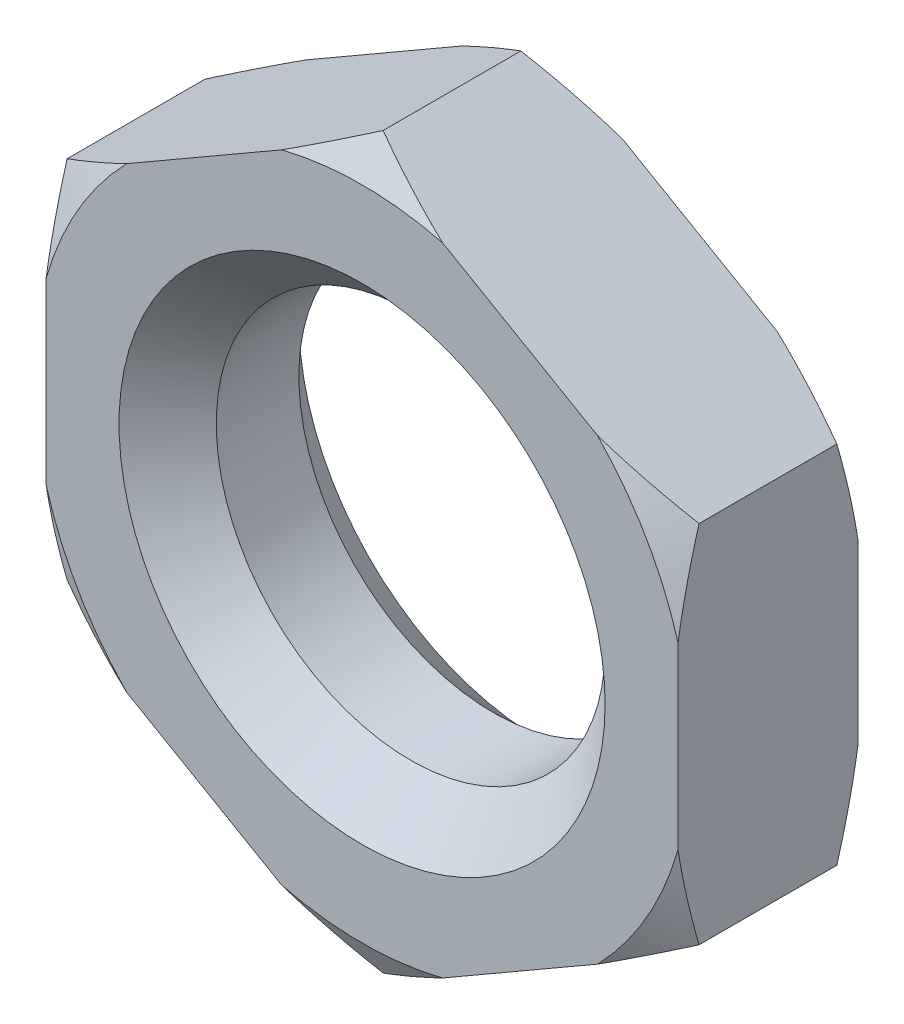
from build123d import *

# Parameters (mm, degrees)
SKETCH1_R           = 4
BOSS_EXTRUDE1_DEPTH = 1.85
CHAMFER1_SIZE       = 1


with BuildPart() as part:
    # Sketch1 → Boss-Extrude1 (new, symmetric)
    with BuildSketch(Plane.XY):
        Polygon((0, 7.505553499), (-6.5, 3.75277675), (-6.5, -3.75277675), (0, -7.505553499), (6.5, -3.75277675), (6.5, 3.75277675), align=None)
        Circle(SKETCH1_R, mode=Mode.SUBTRACT)
    extrude(amount=BOSS_EXTRUDE1_DEPTH, both=True)

    # Sketch3 → Cut-Revolve1 (revolve, cut)
    with BuildSketch(Plane(origin=(0, 0, 0), x_dir=(0, 0, -1), z_dir=(1, 0, 0))):
        Polygon((-1.85, 7.505553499), (-1.85, 6.755553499), (-1.416987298, 7.505553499), align=None)
    cut_revolve1 = revolve(axis=Axis((0, 0, -7.477018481), (0, 0, 1)), mode=Mode.SUBTRACT)

    # Mirror1: Cut-Revolve1 across plane
    add(cut_revolve1.mirror(Plane.XY), mode=Mode.SUBTRACT)

    # Chamfer1
    chamfer1_edges = [part.edges().sort_by_distance(p)[0] for p in [
        (-4, 0, -1.85),
        (-4, 0, 1.85),
    ]]
    chamfer(chamfer1_edges, length=CHAMFER1_SIZE)


solid = part.part
